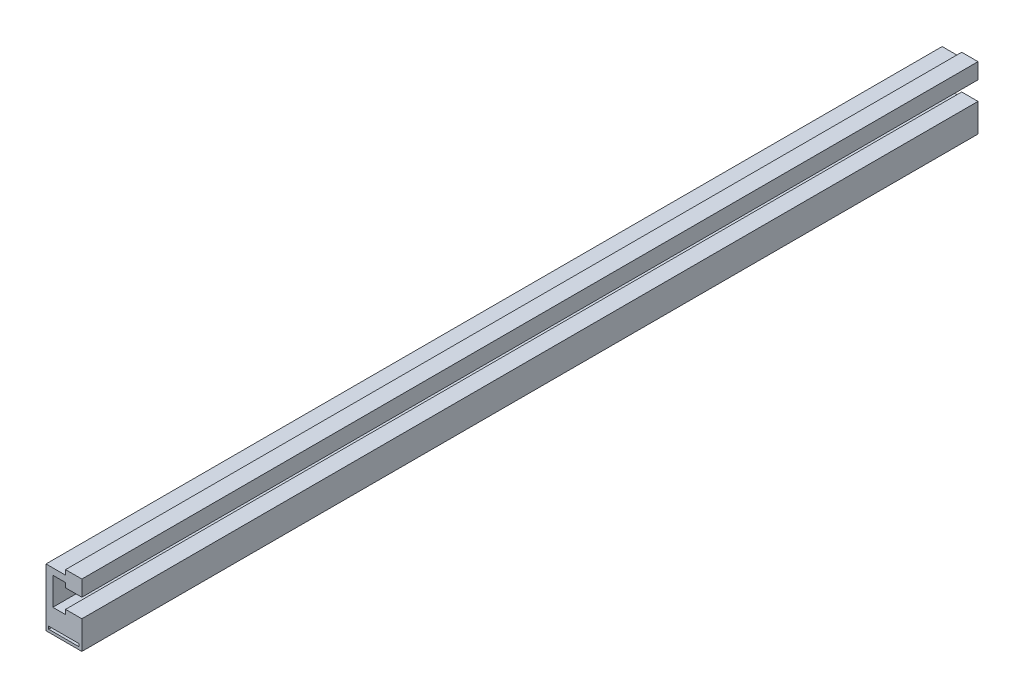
ISO-10303-21;
HEADER;
FILE_DESCRIPTION(('STEP AP214'),'2;1');
FILE_NAME('part.step','',(''),(''),'','','');
FILE_SCHEMA(('AUTOMOTIVE_DESIGN { 1 0 10303 214 1 1 1 1 }'));
ENDSEC;
DATA;
#1=APPLICATION_CONTEXT('core data for automotive mechanical design processes');
#2=APPLICATION_PROTOCOL_DEFINITION('international standard','automotive_design',2000,#1);
#3=PRODUCT_CONTEXT('',#1,'mechanical');
#4=PRODUCT('Part','Part','',(#3));
#5=PRODUCT_RELATED_PRODUCT_CATEGORY('part','',(#4));
#6=PRODUCT_DEFINITION_FORMATION('','',#4);
#7=PRODUCT_DEFINITION_CONTEXT('part definition',#1,'design');
#8=PRODUCT_DEFINITION('design','',#6,#7);
#9=PRODUCT_DEFINITION_SHAPE('','',#8);
#10=(LENGTH_UNIT() NAMED_UNIT(*) SI_UNIT(.MILLI.,.METRE.));
#11=(NAMED_UNIT(*) PLANE_ANGLE_UNIT() SI_UNIT($,.RADIAN.));
#12=(NAMED_UNIT(*) SI_UNIT($,.STERADIAN.) SOLID_ANGLE_UNIT());
#13=UNCERTAINTY_MEASURE_WITH_UNIT(LENGTH_MEASURE(1.E-05),#10,'distance_accuracy_value','');
#14=(GEOMETRIC_REPRESENTATION_CONTEXT(3) GLOBAL_UNCERTAINTY_ASSIGNED_CONTEXT((#13)) GLOBAL_UNIT_ASSIGNED_CONTEXT((#10,
#11,#12)) REPRESENTATION_CONTEXT('',''));
#15=CARTESIAN_POINT('',(0.,0.,0.));
#16=DIRECTION('',(0.,0.,1.));
#17=DIRECTION('',(1.,0.,0.));
#18=AXIS2_PLACEMENT_3D('',#15,#16,#17);
#19=CARTESIAN_POINT('',(10.,26.2,0.));
#20=DIRECTION('',(1.,0.,0.));
#21=DIRECTION('',(0.,0.,-1.));
#22=AXIS2_PLACEMENT_3D('',#19,#20,#21);
#23=PLANE('',#22);
#24=DIRECTION('',(0.,0.,1.));
#25=VECTOR('',#24,1.);
#26=CARTESIAN_POINT('',(10.,26.2,0.));
#27=LINE('',#26,#25);
#28=CARTESIAN_POINT('',(10.,26.2,0.));
#29=VERTEX_POINT('',#28);
#30=CARTESIAN_POINT('',(10.,26.2,500.));
#31=VERTEX_POINT('',#30);
#32=EDGE_CURVE('E9',#29,#31,#27,.T.);
#33=ORIENTED_EDGE('',*,*,#32,.F.);
#34=DIRECTION('',(0.,1.,0.));
#35=VECTOR('',#34,1.);
#36=CARTESIAN_POINT('',(10.,26.2,0.));
#37=LINE('',#36,#35);
#38=CARTESIAN_POINT('',(10.,35.,0.));
#39=VERTEX_POINT('',#38);
#40=EDGE_CURVE('E216',#29,#39,#37,.T.);
#41=ORIENTED_EDGE('',*,*,#40,.T.);
#42=DIRECTION('',(0.,0.,1.));
#43=VECTOR('',#42,1.);
#44=CARTESIAN_POINT('',(10.,35.,0.));
#45=LINE('',#44,#43);
#46=CARTESIAN_POINT('',(10.,35.,500.));
#47=VERTEX_POINT('',#46);
#48=EDGE_CURVE('E258',#39,#47,#45,.T.);
#49=ORIENTED_EDGE('',*,*,#48,.T.);
#50=DIRECTION('',(0.,1.,0.));
#51=VECTOR('',#50,1.);
#52=CARTESIAN_POINT('',(10.,26.2,500.));
#53=LINE('',#52,#51);
#54=EDGE_CURVE('E174',#31,#47,#53,.T.);
#55=ORIENTED_EDGE('',*,*,#54,.F.);
#56=EDGE_LOOP('',(#33,#41,#49,#55));
#57=FACE_BOUND('',#56,.T.);
#58=ADVANCED_FACE('F14',(#57),#23,.T.);
#59=CARTESIAN_POINT('',(10.,26.2,0.));
#60=DIRECTION('',(0.,1.,0.));
#61=DIRECTION('',(0.,0.,-1.));
#62=AXIS2_PLACEMENT_3D('',#59,#60,#61);
#63=PLANE('',#62);
#64=DIRECTION('',(0.,0.,1.));
#65=VECTOR('',#64,1.);
#66=CARTESIAN_POINT('',(0.899999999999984,26.2,0.));
#67=LINE('',#66,#65);
#68=CARTESIAN_POINT('',(0.899999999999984,26.2,0.));
#69=VERTEX_POINT('',#68);
#70=CARTESIAN_POINT('',(0.899999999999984,26.2,500.));
#71=VERTEX_POINT('',#70);
#72=EDGE_CURVE('E22',#69,#71,#67,.T.);
#73=ORIENTED_EDGE('',*,*,#72,.F.);
#74=DIRECTION('',(-1.,0.,0.));
#75=VECTOR('',#74,1.);
#76=CARTESIAN_POINT('',(10.,26.2,0.));
#77=LINE('',#76,#75);
#78=EDGE_CURVE('E255',#29,#69,#77,.T.);
#79=ORIENTED_EDGE('',*,*,#78,.F.);
#80=ORIENTED_EDGE('',*,*,#32,.T.);
#81=DIRECTION('',(-1.,0.,0.));
#82=VECTOR('',#81,1.);
#83=CARTESIAN_POINT('',(10.,26.2,500.));
#84=LINE('',#83,#82);
#85=EDGE_CURVE('E213',#31,#71,#84,.T.);
#86=ORIENTED_EDGE('',*,*,#85,.T.);
#87=EDGE_LOOP('',(#73,#79,#80,#86));
#88=FACE_BOUND('',#87,.T.);
#89=ADVANCED_FACE('F16',(#88),#63,.F.);
#90=CARTESIAN_POINT('',(0.899999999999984,28.75,0.));
#91=DIRECTION('',(-1.,0.,0.));
#92=DIRECTION('',(0.,0.,1.));
#93=AXIS2_PLACEMENT_3D('',#90,#91,#92);
#94=PLANE('',#93);
#95=DIRECTION('',(0.,0.,1.));
#96=VECTOR('',#95,1.);
#97=CARTESIAN_POINT('',(0.899999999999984,28.75,0.));
#98=LINE('',#97,#96);
#99=CARTESIAN_POINT('',(0.899999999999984,28.75,0.));
#100=VERTEX_POINT('',#99);
#101=CARTESIAN_POINT('',(0.899999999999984,28.75,500.));
#102=VERTEX_POINT('',#101);
#103=EDGE_CURVE('E280',#100,#102,#98,.T.);
#104=ORIENTED_EDGE('',*,*,#103,.F.);
#105=DIRECTION('',(0.,-1.,0.));
#106=VECTOR('',#105,1.);
#107=CARTESIAN_POINT('',(0.899999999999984,28.75,0.));
#108=LINE('',#107,#106);
#109=EDGE_CURVE('E252',#100,#69,#108,.T.);
#110=ORIENTED_EDGE('',*,*,#109,.T.);
#111=ORIENTED_EDGE('',*,*,#72,.T.);
#112=DIRECTION('',(0.,-1.,0.));
#113=VECTOR('',#112,1.);
#114=CARTESIAN_POINT('',(0.899999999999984,28.75,500.));
#115=LINE('',#114,#113);
#116=EDGE_CURVE('E210',#102,#71,#115,.T.);
#117=ORIENTED_EDGE('',*,*,#116,.F.);
#118=EDGE_LOOP('',(#104,#110,#111,#117));
#119=FACE_BOUND('',#118,.T.);
#120=ADVANCED_FACE('F283',(#119),#94,.T.);
#121=CARTESIAN_POINT('',(0.899999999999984,28.75,0.));
#122=DIRECTION('',(0.,1.,0.));
#123=DIRECTION('',(1.,0.,0.));
#124=AXIS2_PLACEMENT_3D('',#121,#122,#123);
#125=PLANE('',#124);
#126=DIRECTION('',(0.,0.,1.));
#127=VECTOR('',#126,1.);
#128=CARTESIAN_POINT('',(-6.2,28.75,0.));
#129=LINE('',#128,#127);
#130=CARTESIAN_POINT('',(-6.2,28.75,0.));
#131=VERTEX_POINT('',#130);
#132=CARTESIAN_POINT('',(-6.2,28.75,500.));
#133=VERTEX_POINT('',#132);
#134=EDGE_CURVE('E278',#131,#133,#129,.T.);
#135=ORIENTED_EDGE('',*,*,#134,.F.);
#136=DIRECTION('',(-1.,0.,0.));
#137=VECTOR('',#136,1.);
#138=CARTESIAN_POINT('',(0.899999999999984,28.75,0.));
#139=LINE('',#138,#137);
#140=EDGE_CURVE('E249',#100,#131,#139,.T.);
#141=ORIENTED_EDGE('',*,*,#140,.F.);
#142=ORIENTED_EDGE('',*,*,#103,.T.);
#143=DIRECTION('',(-1.,0.,0.));
#144=VECTOR('',#143,1.);
#145=CARTESIAN_POINT('',(0.899999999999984,28.75,500.));
#146=LINE('',#145,#144);
#147=EDGE_CURVE('E207',#102,#133,#146,.T.);
#148=ORIENTED_EDGE('',*,*,#147,.T.);
#149=EDGE_LOOP('',(#135,#141,#142,#148));
#150=FACE_BOUND('',#149,.T.);
#151=ADVANCED_FACE('F333',(#150),#125,.F.);
#152=CARTESIAN_POINT('',(-6.2,28.75,0.));
#153=DIRECTION('',(-1.,0.,0.));
#154=DIRECTION('',(0.,0.,1.));
#155=AXIS2_PLACEMENT_3D('',#152,#153,#154);
#156=PLANE('',#155);
#157=DIRECTION('',(0.,0.,1.));
#158=VECTOR('',#157,1.);
#159=CARTESIAN_POINT('',(-6.2,13.25,0.));
#160=LINE('',#159,#158);
#161=CARTESIAN_POINT('',(-6.2,13.25,0.));
#162=VERTEX_POINT('',#161);
#163=CARTESIAN_POINT('',(-6.2,13.25,500.));
#164=VERTEX_POINT('',#163);
#165=EDGE_CURVE('E276',#162,#164,#160,.T.);
#166=ORIENTED_EDGE('',*,*,#165,.F.);
#167=DIRECTION('',(0.,-1.,0.));
#168=VECTOR('',#167,1.);
#169=CARTESIAN_POINT('',(-6.2,28.75,0.));
#170=LINE('',#169,#168);
#171=EDGE_CURVE('E246',#131,#162,#170,.T.);
#172=ORIENTED_EDGE('',*,*,#171,.F.);
#173=ORIENTED_EDGE('',*,*,#134,.T.);
#174=DIRECTION('',(0.,-1.,0.));
#175=VECTOR('',#174,1.);
#176=CARTESIAN_POINT('',(-6.2,28.75,500.));
#177=LINE('',#176,#175);
#178=EDGE_CURVE('E204',#133,#164,#177,.T.);
#179=ORIENTED_EDGE('',*,*,#178,.T.);
#180=EDGE_LOOP('',(#166,#172,#173,#179));
#181=FACE_BOUND('',#180,.T.);
#182=ADVANCED_FACE('F331',(#181),#156,.F.);
#183=CARTESIAN_POINT('',(0.899999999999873,13.25,0.));
#184=DIRECTION('',(0.,1.,0.));
#185=DIRECTION('',(0.,0.,-1.));
#186=AXIS2_PLACEMENT_3D('',#183,#184,#185);
#187=PLANE('',#186);
#188=DIRECTION('',(0.,0.,1.));
#189=VECTOR('',#188,1.);
#190=CARTESIAN_POINT('',(0.899999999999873,13.25,0.));
#191=LINE('',#190,#189);
#192=CARTESIAN_POINT('',(0.899999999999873,13.25,0.));
#193=VERTEX_POINT('',#192);
#194=CARTESIAN_POINT('',(0.899999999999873,13.25,500.));
#195=VERTEX_POINT('',#194);
#196=EDGE_CURVE('E274',#193,#195,#191,.T.);
#197=ORIENTED_EDGE('',*,*,#196,.F.);
#198=DIRECTION('',(-1.,0.,0.));
#199=VECTOR('',#198,1.);
#200=CARTESIAN_POINT('',(0.899999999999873,13.25,0.));
#201=LINE('',#200,#199);
#202=EDGE_CURVE('E243',#193,#162,#201,.T.);
#203=ORIENTED_EDGE('',*,*,#202,.T.);
#204=ORIENTED_EDGE('',*,*,#165,.T.);
#205=DIRECTION('',(-1.,0.,0.));
#206=VECTOR('',#205,1.);
#207=CARTESIAN_POINT('',(0.899999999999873,13.25,500.));
#208=LINE('',#207,#206);
#209=EDGE_CURVE('E201',#195,#164,#208,.T.);
#210=ORIENTED_EDGE('',*,*,#209,.F.);
#211=EDGE_LOOP('',(#197,#203,#204,#210));
#212=FACE_BOUND('',#211,.T.);
#213=ADVANCED_FACE('F328',(#212),#187,.T.);
#214=CARTESIAN_POINT('',(0.899999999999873,15.8,0.));
#215=DIRECTION('',(-1.,0.,0.));
#216=DIRECTION('',(0.,0.,1.));
#217=AXIS2_PLACEMENT_3D('',#214,#215,#216);
#218=PLANE('',#217);
#219=DIRECTION('',(0.,0.,1.));
#220=VECTOR('',#219,1.);
#221=CARTESIAN_POINT('',(0.899999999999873,15.8,0.));
#222=LINE('',#221,#220);
#223=CARTESIAN_POINT('',(0.899999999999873,15.8,0.));
#224=VERTEX_POINT('',#223);
#225=CARTESIAN_POINT('',(0.899999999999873,15.8,500.));
#226=VERTEX_POINT('',#225);
#227=EDGE_CURVE('E272',#224,#226,#222,.T.);
#228=ORIENTED_EDGE('',*,*,#227,.F.);
#229=DIRECTION('',(0.,-1.,0.));
#230=VECTOR('',#229,1.);
#231=CARTESIAN_POINT('',(0.899999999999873,15.8,0.));
#232=LINE('',#231,#230);
#233=EDGE_CURVE('E240',#224,#193,#232,.T.);
#234=ORIENTED_EDGE('',*,*,#233,.T.);
#235=ORIENTED_EDGE('',*,*,#196,.T.);
#236=DIRECTION('',(0.,-1.,0.));
#237=VECTOR('',#236,1.);
#238=CARTESIAN_POINT('',(0.899999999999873,15.8,500.));
#239=LINE('',#238,#237);
#240=EDGE_CURVE('E198',#226,#195,#239,.T.);
#241=ORIENTED_EDGE('',*,*,#240,.F.);
#242=EDGE_LOOP('',(#228,#234,#235,#241));
#243=FACE_BOUND('',#242,.T.);
#244=ADVANCED_FACE('F324',(#243),#218,.T.);
#245=CARTESIAN_POINT('',(10.,15.8,0.));
#246=DIRECTION('',(0.,1.,0.));
#247=DIRECTION('',(0.,0.,-1.));
#248=AXIS2_PLACEMENT_3D('',#245,#246,#247);
#249=PLANE('',#248);
#250=DIRECTION('',(0.,0.,1.));
#251=VECTOR('',#250,1.);
#252=CARTESIAN_POINT('',(10.,15.8,0.));
#253=LINE('',#252,#251);
#254=CARTESIAN_POINT('',(10.,15.8,0.));
#255=VERTEX_POINT('',#254);
#256=CARTESIAN_POINT('',(10.,15.8,500.));
#257=VERTEX_POINT('',#256);
#258=EDGE_CURVE('E270',#255,#257,#253,.T.);
#259=ORIENTED_EDGE('',*,*,#258,.F.);
#260=DIRECTION('',(-1.,0.,0.));
#261=VECTOR('',#260,1.);
#262=CARTESIAN_POINT('',(10.,15.8,0.));
#263=LINE('',#262,#261);
#264=EDGE_CURVE('E237',#255,#224,#263,.T.);
#265=ORIENTED_EDGE('',*,*,#264,.T.);
#266=ORIENTED_EDGE('',*,*,#227,.T.);
#267=DIRECTION('',(-1.,0.,0.));
#268=VECTOR('',#267,1.);
#269=CARTESIAN_POINT('',(10.,15.8,500.));
#270=LINE('',#269,#268);
#271=EDGE_CURVE('E195',#257,#226,#270,.T.);
#272=ORIENTED_EDGE('',*,*,#271,.F.);
#273=EDGE_LOOP('',(#259,#265,#266,#272));
#274=FACE_BOUND('',#273,.T.);
#275=ADVANCED_FACE('F321',(#274),#249,.T.);
#276=CARTESIAN_POINT('',(10.,0.,0.));
#277=DIRECTION('',(1.,0.,0.));
#278=DIRECTION('',(0.,0.,-1.));
#279=AXIS2_PLACEMENT_3D('',#276,#277,#278);
#280=PLANE('',#279);
#281=DIRECTION('',(0.,0.,1.));
#282=VECTOR('',#281,1.);
#283=CARTESIAN_POINT('',(10.,0.,0.));
#284=LINE('',#283,#282);
#285=CARTESIAN_POINT('',(10.,0.,0.));
#286=VERTEX_POINT('',#285);
#287=CARTESIAN_POINT('',(10.,0.,500.));
#288=VERTEX_POINT('',#287);
#289=EDGE_CURVE('E268',#286,#288,#284,.T.);
#290=ORIENTED_EDGE('',*,*,#289,.F.);
#291=DIRECTION('',(0.,1.,0.));
#292=VECTOR('',#291,1.);
#293=CARTESIAN_POINT('',(10.,0.,0.));
#294=LINE('',#293,#292);
#295=EDGE_CURVE('E234',#286,#255,#294,.T.);
#296=ORIENTED_EDGE('',*,*,#295,.T.);
#297=ORIENTED_EDGE('',*,*,#258,.T.);
#298=DIRECTION('',(0.,1.,0.));
#299=VECTOR('',#298,1.);
#300=CARTESIAN_POINT('',(10.,0.,500.));
#301=LINE('',#300,#299);
#302=EDGE_CURVE('E192',#288,#257,#301,.T.);
#303=ORIENTED_EDGE('',*,*,#302,.F.);
#304=EDGE_LOOP('',(#290,#296,#297,#303));
#305=FACE_BOUND('',#304,.T.);
#306=ADVANCED_FACE('F316',(#305),#280,.T.);
#307=CARTESIAN_POINT('',(10.,0.,0.));
#308=DIRECTION('',(0.,1.,0.));
#309=DIRECTION('',(1.,0.,0.));
#310=AXIS2_PLACEMENT_3D('',#307,#308,#309);
#311=PLANE('',#310);
#312=DIRECTION('',(0.,0.,1.));
#313=VECTOR('',#312,1.);
#314=CARTESIAN_POINT('',(-10.,0.,0.));
#315=LINE('',#314,#313);
#316=CARTESIAN_POINT('',(-10.,0.,0.));
#317=VERTEX_POINT('',#316);
#318=CARTESIAN_POINT('',(-10.,0.,500.));
#319=VERTEX_POINT('',#318);
#320=EDGE_CURVE('E266',#317,#319,#315,.T.);
#321=ORIENTED_EDGE('',*,*,#320,.F.);
#322=DIRECTION('',(-1.,0.,0.));
#323=VECTOR('',#322,1.);
#324=CARTESIAN_POINT('',(10.,0.,0.));
#325=LINE('',#324,#323);
#326=EDGE_CURVE('E231',#286,#317,#325,.T.);
#327=ORIENTED_EDGE('',*,*,#326,.F.);
#328=ORIENTED_EDGE('',*,*,#289,.T.);
#329=DIRECTION('',(-1.,0.,0.));
#330=VECTOR('',#329,1.);
#331=CARTESIAN_POINT('',(10.,0.,500.));
#332=LINE('',#331,#330);
#333=EDGE_CURVE('E189',#288,#319,#332,.T.);
#334=ORIENTED_EDGE('',*,*,#333,.T.);
#335=EDGE_LOOP('',(#321,#327,#328,#334));
#336=FACE_BOUND('',#335,.T.);
#337=ADVANCED_FACE('F312',(#336),#311,.F.);
#338=CARTESIAN_POINT('',(-10.,0.,0.));
#339=DIRECTION('',(1.,0.,0.));
#340=DIRECTION('',(0.,0.,-1.));
#341=AXIS2_PLACEMENT_3D('',#338,#339,#340);
#342=PLANE('',#341);
#343=DIRECTION('',(0.,0.,1.));
#344=VECTOR('',#343,1.);
#345=CARTESIAN_POINT('',(-10.,32.3,0.));
#346=LINE('',#345,#344);
#347=CARTESIAN_POINT('',(-10.,32.3,0.));
#348=VERTEX_POINT('',#347);
#349=CARTESIAN_POINT('',(-10.,32.3,500.));
#350=VERTEX_POINT('',#349);
#351=EDGE_CURVE('E264',#348,#350,#346,.T.);
#352=ORIENTED_EDGE('',*,*,#351,.F.);
#353=DIRECTION('',(0.,1.,0.));
#354=VECTOR('',#353,1.);
#355=CARTESIAN_POINT('',(-10.,0.,0.));
#356=LINE('',#355,#354);
#357=EDGE_CURVE('E228',#317,#348,#356,.T.);
#358=ORIENTED_EDGE('',*,*,#357,.F.);
#359=ORIENTED_EDGE('',*,*,#320,.T.);
#360=DIRECTION('',(0.,1.,0.));
#361=VECTOR('',#360,1.);
#362=CARTESIAN_POINT('',(-10.,0.,500.));
#363=LINE('',#362,#361);
#364=EDGE_CURVE('E186',#319,#350,#363,.T.);
#365=ORIENTED_EDGE('',*,*,#364,.T.);
#366=EDGE_LOOP('',(#352,#358,#359,#365));
#367=FACE_BOUND('',#366,.T.);
#368=ADVANCED_FACE('F308',(#367),#342,.F.);
#369=CARTESIAN_POINT('',(0.899999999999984,32.3,0.));
#370=DIRECTION('',(0.,1.,0.));
#371=DIRECTION('',(0.,0.,-1.));
#372=AXIS2_PLACEMENT_3D('',#369,#370,#371);
#373=PLANE('',#372);
#374=DIRECTION('',(0.,0.,1.));
#375=VECTOR('',#374,1.);
#376=CARTESIAN_POINT('',(0.899999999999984,32.3,0.));
#377=LINE('',#376,#375);
#378=CARTESIAN_POINT('',(0.899999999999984,32.3,0.));
#379=VERTEX_POINT('',#378);
#380=CARTESIAN_POINT('',(0.899999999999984,32.3,500.));
#381=VERTEX_POINT('',#380);
#382=EDGE_CURVE('E262',#379,#381,#377,.T.);
#383=ORIENTED_EDGE('',*,*,#382,.F.);
#384=DIRECTION('',(-1.,0.,0.));
#385=VECTOR('',#384,1.);
#386=CARTESIAN_POINT('',(0.899999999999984,32.3,0.));
#387=LINE('',#386,#385);
#388=EDGE_CURVE('E225',#379,#348,#387,.T.);
#389=ORIENTED_EDGE('',*,*,#388,.T.);
#390=ORIENTED_EDGE('',*,*,#351,.T.);
#391=DIRECTION('',(-1.,0.,0.));
#392=VECTOR('',#391,1.);
#393=CARTESIAN_POINT('',(0.899999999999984,32.3,500.));
#394=LINE('',#393,#392);
#395=EDGE_CURVE('E183',#381,#350,#394,.T.);
#396=ORIENTED_EDGE('',*,*,#395,.F.);
#397=EDGE_LOOP('',(#383,#389,#390,#396));
#398=FACE_BOUND('',#397,.T.);
#399=ADVANCED_FACE('F305',(#398),#373,.T.);
#400=CARTESIAN_POINT('',(0.899999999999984,32.3,0.));
#401=DIRECTION('',(1.,0.,0.));
#402=DIRECTION('',(0.,0.,-1.));
#403=AXIS2_PLACEMENT_3D('',#400,#401,#402);
#404=PLANE('',#403);
#405=DIRECTION('',(0.,0.,1.));
#406=VECTOR('',#405,1.);
#407=CARTESIAN_POINT('',(0.899999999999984,35.,0.));
#408=LINE('',#407,#406);
#409=CARTESIAN_POINT('',(0.899999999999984,35.,0.));
#410=VERTEX_POINT('',#409);
#411=CARTESIAN_POINT('',(0.899999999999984,35.,500.));
#412=VERTEX_POINT('',#411);
#413=EDGE_CURVE('E260',#410,#412,#408,.T.);
#414=ORIENTED_EDGE('',*,*,#413,.F.);
#415=DIRECTION('',(0.,1.,0.));
#416=VECTOR('',#415,1.);
#417=CARTESIAN_POINT('',(0.899999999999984,32.3,0.));
#418=LINE('',#417,#416);
#419=EDGE_CURVE('E222',#379,#410,#418,.T.);
#420=ORIENTED_EDGE('',*,*,#419,.F.);
#421=ORIENTED_EDGE('',*,*,#382,.T.);
#422=DIRECTION('',(0.,1.,0.));
#423=VECTOR('',#422,1.);
#424=CARTESIAN_POINT('',(0.899999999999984,32.3,500.));
#425=LINE('',#424,#423);
#426=EDGE_CURVE('E180',#381,#412,#425,.T.);
#427=ORIENTED_EDGE('',*,*,#426,.T.);
#428=EDGE_LOOP('',(#414,#420,#421,#427));
#429=FACE_BOUND('',#428,.T.);
#430=ADVANCED_FACE('F300',(#429),#404,.F.);
#431=CARTESIAN_POINT('',(10.,35.,0.));
#432=DIRECTION('',(0.,1.,0.));
#433=DIRECTION('',(1.,0.,0.));
#434=AXIS2_PLACEMENT_3D('',#431,#432,#433);
#435=PLANE('',#434);
#436=DIRECTION('',(-1.,0.,0.));
#437=VECTOR('',#436,1.);
#438=CARTESIAN_POINT('',(10.,35.,0.));
#439=LINE('',#438,#437);
#440=EDGE_CURVE('E219',#39,#410,#439,.T.);
#441=ORIENTED_EDGE('',*,*,#440,.T.);
#442=ORIENTED_EDGE('',*,*,#413,.T.);
#443=DIRECTION('',(-1.,0.,0.));
#444=VECTOR('',#443,1.);
#445=CARTESIAN_POINT('',(10.,35.,500.));
#446=LINE('',#445,#444);
#447=EDGE_CURVE('E177',#47,#412,#446,.T.);
#448=ORIENTED_EDGE('',*,*,#447,.F.);
#449=ORIENTED_EDGE('',*,*,#48,.F.);
#450=EDGE_LOOP('',(#441,#442,#448,#449));
#451=FACE_BOUND('',#450,.T.);
#452=ADVANCED_FACE('F296',(#451),#435,.T.);
#453=CARTESIAN_POINT('',(10.,32.3,0.));
#454=DIRECTION('',(0.,0.,1.));
#455=DIRECTION('',(1.,0.,0.));
#456=AXIS2_PLACEMENT_3D('',#453,#454,#455);
#457=PLANE('',#456);
#458=DIRECTION('',(0.,1.,0.));
#459=VECTOR('',#458,1.);
#460=CARTESIAN_POINT('',(-8.5,1.50000000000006,0.));
#461=LINE('',#460,#459);
#462=CARTESIAN_POINT('',(-8.5,1.50000000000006,0.));
#463=VERTEX_POINT('',#462);
#464=CARTESIAN_POINT('',(-8.5,3.00000000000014,0.));
#465=VERTEX_POINT('',#464);
#466=EDGE_CURVE('E167',#463,#465,#461,.T.);
#467=ORIENTED_EDGE('',*,*,#466,.F.);
#468=DIRECTION('',(1.,0.,0.));
#469=VECTOR('',#468,1.);
#470=CARTESIAN_POINT('',(-8.5,1.50000000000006,0.));
#471=LINE('',#470,#469);
#472=CARTESIAN_POINT('',(8.5,1.49999999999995,0.));
#473=VERTEX_POINT('',#472);
#474=EDGE_CURVE('E158',#463,#473,#471,.T.);
#475=ORIENTED_EDGE('',*,*,#474,.T.);
#476=DIRECTION('',(0.,-1.,0.));
#477=VECTOR('',#476,1.);
#478=CARTESIAN_POINT('',(8.5,3.00000000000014,0.));
#479=LINE('',#478,#477);
#480=CARTESIAN_POINT('',(8.5,3.00000000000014,0.));
#481=VERTEX_POINT('',#480);
#482=EDGE_CURVE('E164',#481,#473,#479,.T.);
#483=ORIENTED_EDGE('',*,*,#482,.F.);
#484=DIRECTION('',(-1.,0.,0.));
#485=VECTOR('',#484,1.);
#486=CARTESIAN_POINT('',(8.5,3.00000000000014,0.));
#487=LINE('',#486,#485);
#488=EDGE_CURVE('E29',#481,#465,#487,.T.);
#489=ORIENTED_EDGE('',*,*,#488,.T.);
#490=EDGE_LOOP('',(#467,#475,#483,#489));
#491=FACE_BOUND('',#490,.T.);
#492=ORIENTED_EDGE('',*,*,#40,.F.);
#493=ORIENTED_EDGE('',*,*,#78,.T.);
#494=ORIENTED_EDGE('',*,*,#109,.F.);
#495=ORIENTED_EDGE('',*,*,#140,.T.);
#496=ORIENTED_EDGE('',*,*,#171,.T.);
#497=ORIENTED_EDGE('',*,*,#202,.F.);
#498=ORIENTED_EDGE('',*,*,#233,.F.);
#499=ORIENTED_EDGE('',*,*,#264,.F.);
#500=ORIENTED_EDGE('',*,*,#295,.F.);
#501=ORIENTED_EDGE('',*,*,#326,.T.);
#502=ORIENTED_EDGE('',*,*,#357,.T.);
#503=ORIENTED_EDGE('',*,*,#388,.F.);
#504=ORIENTED_EDGE('',*,*,#419,.T.);
#505=ORIENTED_EDGE('',*,*,#440,.F.);
#506=EDGE_LOOP('',(#492,#493,#494,#495,#496,#497,#498,#499,#500,#501,#502,#503,#504,#505));
#507=FACE_BOUND('',#506,.T.);
#508=ADVANCED_FACE('F336',(#491,#507),#457,.F.);
#509=CARTESIAN_POINT('',(10.,32.3,500.));
#510=DIRECTION('',(0.,0.,1.));
#511=DIRECTION('',(1.,0.,0.));
#512=AXIS2_PLACEMENT_3D('',#509,#510,#511);
#513=PLANE('',#512);
#514=DIRECTION('',(1.,0.,0.));
#515=VECTOR('',#514,1.);
#516=CARTESIAN_POINT('',(-8.5,1.50000000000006,500.));
#517=LINE('',#516,#515);
#518=CARTESIAN_POINT('',(-8.5,1.50000000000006,500.));
#519=VERTEX_POINT('',#518);
#520=CARTESIAN_POINT('',(8.5,1.49999999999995,500.));
#521=VERTEX_POINT('',#520);
#522=EDGE_CURVE('E37',#519,#521,#517,.T.);
#523=ORIENTED_EDGE('',*,*,#522,.F.);
#524=DIRECTION('',(0.,1.,0.));
#525=VECTOR('',#524,1.);
#526=CARTESIAN_POINT('',(-8.5,1.50000000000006,500.));
#527=LINE('',#526,#525);
#528=CARTESIAN_POINT('',(-8.5,3.00000000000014,500.));
#529=VERTEX_POINT('',#528);
#530=EDGE_CURVE('E156',#519,#529,#527,.T.);
#531=ORIENTED_EDGE('',*,*,#530,.T.);
#532=DIRECTION('',(-1.,0.,0.));
#533=VECTOR('',#532,1.);
#534=CARTESIAN_POINT('',(8.5,3.00000000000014,500.));
#535=LINE('',#534,#533);
#536=CARTESIAN_POINT('',(8.5,3.00000000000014,500.));
#537=VERTEX_POINT('',#536);
#538=EDGE_CURVE('E140',#537,#529,#535,.T.);
#539=ORIENTED_EDGE('',*,*,#538,.F.);
#540=DIRECTION('',(0.,-1.,0.));
#541=VECTOR('',#540,1.);
#542=CARTESIAN_POINT('',(8.5,3.00000000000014,500.));
#543=LINE('',#542,#541);
#544=EDGE_CURVE('E149',#537,#521,#543,.T.);
#545=ORIENTED_EDGE('',*,*,#544,.T.);
#546=EDGE_LOOP('',(#523,#531,#539,#545));
#547=FACE_BOUND('',#546,.T.);
#548=ORIENTED_EDGE('',*,*,#54,.T.);
#549=ORIENTED_EDGE('',*,*,#447,.T.);
#550=ORIENTED_EDGE('',*,*,#426,.F.);
#551=ORIENTED_EDGE('',*,*,#395,.T.);
#552=ORIENTED_EDGE('',*,*,#364,.F.);
#553=ORIENTED_EDGE('',*,*,#333,.F.);
#554=ORIENTED_EDGE('',*,*,#302,.T.);
#555=ORIENTED_EDGE('',*,*,#271,.T.);
#556=ORIENTED_EDGE('',*,*,#240,.T.);
#557=ORIENTED_EDGE('',*,*,#209,.T.);
#558=ORIENTED_EDGE('',*,*,#178,.F.);
#559=ORIENTED_EDGE('',*,*,#147,.F.);
#560=ORIENTED_EDGE('',*,*,#116,.T.);
#561=ORIENTED_EDGE('',*,*,#85,.F.);
#562=EDGE_LOOP('',(#548,#549,#550,#551,#552,#553,#554,#555,#556,#557,#558,#559,#560,#561));
#563=FACE_BOUND('',#562,.T.);
#564=ADVANCED_FACE('F153',(#547,#563),#513,.T.);
#565=CARTESIAN_POINT('',(-8.5,1.50000000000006,0.));
#566=DIRECTION('',(0.,-1.,0.));
#567=DIRECTION('',(-1.,0.,0.));
#568=AXIS2_PLACEMENT_3D('',#565,#566,#567);
#569=PLANE('',#568);
#570=DIRECTION('',(0.,0.,1.));
#571=VECTOR('',#570,1.);
#572=CARTESIAN_POINT('',(-8.5,1.50000000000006,0.));
#573=LINE('',#572,#571);
#574=EDGE_CURVE('E172',#463,#519,#573,.T.);
#575=ORIENTED_EDGE('',*,*,#574,.T.);
#576=ORIENTED_EDGE('',*,*,#522,.T.);
#577=DIRECTION('',(0.,0.,1.));
#578=VECTOR('',#577,1.);
#579=CARTESIAN_POINT('',(8.5,1.49999999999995,0.));
#580=LINE('',#579,#578);
#581=EDGE_CURVE('E146',#473,#521,#580,.T.);
#582=ORIENTED_EDGE('',*,*,#581,.F.);
#583=ORIENTED_EDGE('',*,*,#474,.F.);
#584=EDGE_LOOP('',(#575,#576,#582,#583));
#585=FACE_BOUND('',#584,.T.);
#586=ADVANCED_FACE('F346',(#585),#569,.F.);
#587=CARTESIAN_POINT('',(-8.5,1.50000000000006,0.));
#588=DIRECTION('',(1.,0.,0.));
#589=DIRECTION('',(0.,0.,-1.));
#590=AXIS2_PLACEMENT_3D('',#587,#588,#589);
#591=PLANE('',#590);
#592=DIRECTION('',(0.,0.,1.));
#593=VECTOR('',#592,1.);
#594=CARTESIAN_POINT('',(-8.5,3.00000000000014,0.));
#595=LINE('',#594,#593);
#596=EDGE_CURVE('E145',#465,#529,#595,.T.);
#597=ORIENTED_EDGE('',*,*,#596,.T.);
#598=ORIENTED_EDGE('',*,*,#530,.F.);
#599=ORIENTED_EDGE('',*,*,#574,.F.);
#600=ORIENTED_EDGE('',*,*,#466,.T.);
#601=EDGE_LOOP('',(#597,#598,#599,#600));
#602=FACE_BOUND('',#601,.T.);
#603=ADVANCED_FACE('F463',(#602),#591,.T.);
#604=CARTESIAN_POINT('',(8.5,3.00000000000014,0.));
#605=DIRECTION('',(0.,1.,0.));
#606=DIRECTION('',(0.,0.,-1.));
#607=AXIS2_PLACEMENT_3D('',#604,#605,#606);
#608=PLANE('',#607);
#609=DIRECTION('',(0.,0.,1.));
#610=VECTOR('',#609,1.);
#611=CARTESIAN_POINT('',(8.5,3.00000000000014,0.));
#612=LINE('',#611,#610);
#613=EDGE_CURVE('E136',#481,#537,#612,.T.);
#614=ORIENTED_EDGE('',*,*,#613,.T.);
#615=ORIENTED_EDGE('',*,*,#538,.T.);
#616=ORIENTED_EDGE('',*,*,#596,.F.);
#617=ORIENTED_EDGE('',*,*,#488,.F.);
#618=EDGE_LOOP('',(#614,#615,#616,#617));
#619=FACE_BOUND('',#618,.T.);
#620=ADVANCED_FACE('F138',(#619),#608,.F.);
#621=CARTESIAN_POINT('',(8.5,3.00000000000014,0.));
#622=DIRECTION('',(-1.,0.,0.));
#623=DIRECTION('',(0.,0.,1.));
#624=AXIS2_PLACEMENT_3D('',#621,#622,#623);
#625=PLANE('',#624);
#626=ORIENTED_EDGE('',*,*,#482,.T.);
#627=ORIENTED_EDGE('',*,*,#581,.T.);
#628=ORIENTED_EDGE('',*,*,#544,.F.);
#629=ORIENTED_EDGE('',*,*,#613,.F.);
#630=EDGE_LOOP('',(#626,#627,#628,#629));
#631=FACE_BOUND('',#630,.T.);
#632=ADVANCED_FACE('F150',(#631),#625,.T.);
#633=CLOSED_SHELL('',(#58,#89,#120,#151,#182,#213,#244,#275,#306,#337,#368,#399,#430,#452,#508,
#564,#586,#603,#620,#632));
#634=MANIFOLD_SOLID_BREP('B1',#633);
#635=ADVANCED_BREP_SHAPE_REPRESENTATION('',(#18,#634),#14);
#636=SHAPE_DEFINITION_REPRESENTATION(#9,#635);
ENDSEC;
END-ISO-10303-21;
